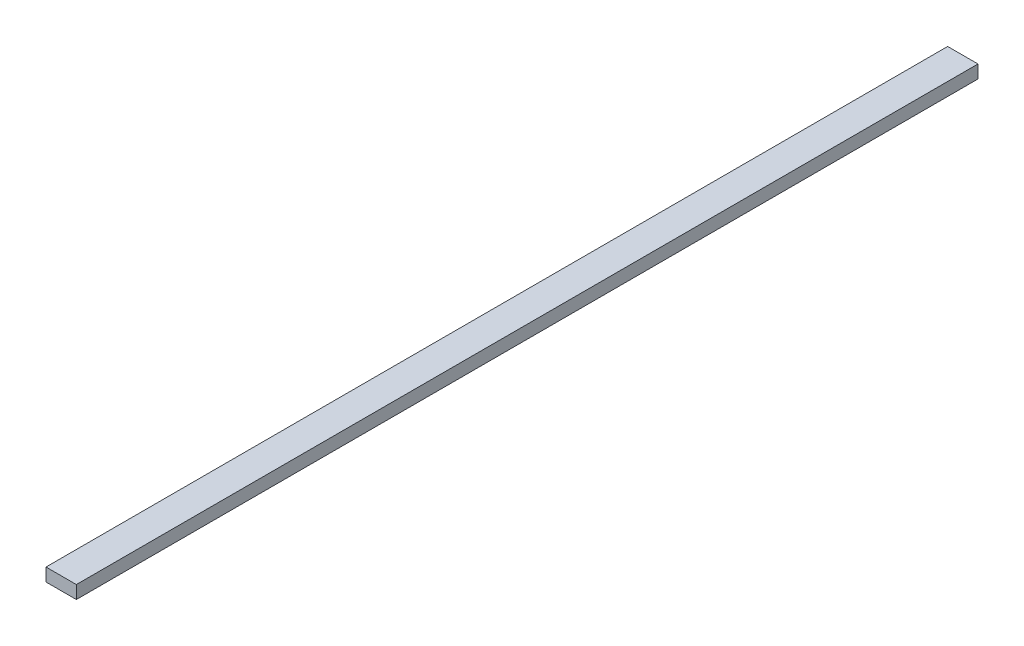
from build123d import *

# Parameters (mm, degrees)
SKETCH1_W           = 88.9
SKETCH1_H           = 38.1
BOSS_EXTRUDE1_DEPTH = 1320.8


with BuildPart() as part:
    # Sketch1 → Boss-Extrude1 (new, symmetric)
    with BuildSketch(Plane.XY):
        Rectangle(SKETCH1_W, SKETCH1_H)
    extrude(amount=BOSS_EXTRUDE1_DEPTH, both=True)


solid = part.part
